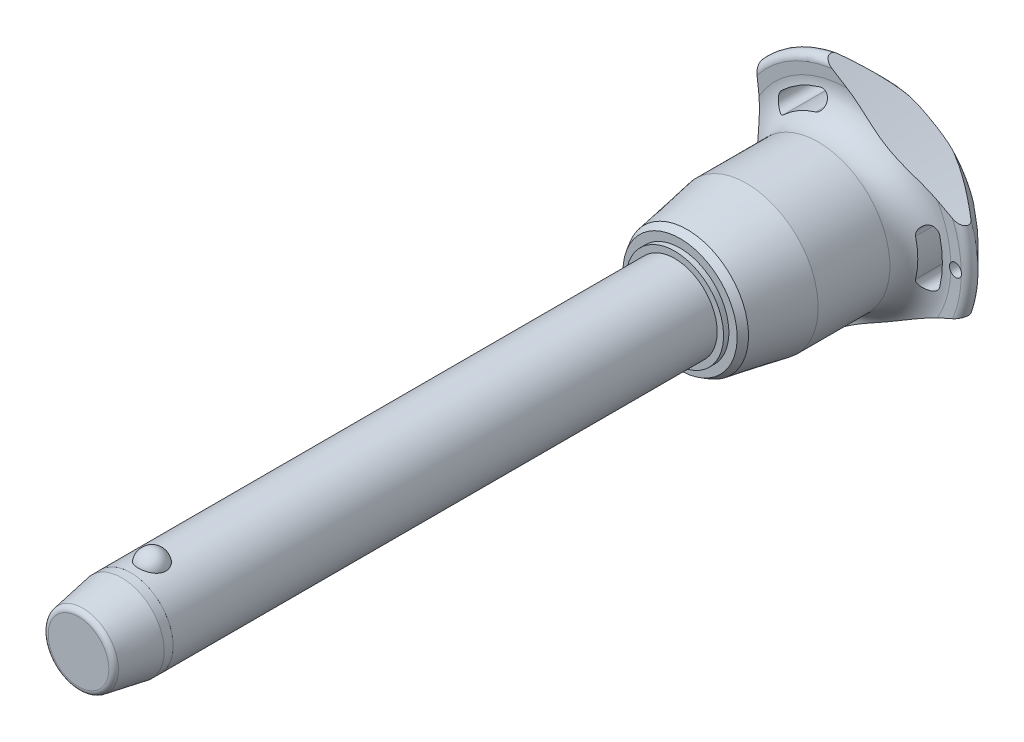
from build123d import *

# Parameters (mm, degrees)
SKETCH1_R           = 10
BOSS_EXTRUDE1_DEPTH = 120
SKETCH2_R           = 8.75
BOSS_EXTRUDE2_DEPTH = 50.7
BOSS_EXTRUDE3_START = 20.5
SKETCH1_2_R         = 10
BOSS_EXTRUDE3_DEPTH = 20.5
CHAMFER1_SIZE       = 10.25
CHAMFER1_SIZE2      = 1.807351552
FILLET1_R           = 1.25
SKETCH6_R           = 176.92625
CUT_EXTRUDE1_DEPTH  = 176.410549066
CIRPATTERN1_COUNT   = 3
SKETCH7_R           = 1.5
CUT_EXTRUDE2_DEPTH  = 176.323744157
SKETCH8_R           = 10
SKETCH8_R_2         = 9.99
CUT_EXTRUDE3_DEPTH  = 12.3


with BuildPart() as part:
    # Sketch1 → Boss-Extrude1 (new body)
    with BuildSketch(Plane.XY):
        Circle(SKETCH1_R)
    extrude(amount=-BOSS_EXTRUDE1_DEPTH)

    # Sketch2 → Boss-Extrude2 (add)
    with BuildSketch(Plane(origin=(0, 0, -120), x_dir=(-1, 0, 0), z_dir=(0, 0, -1))):
        with Locations(Location((0, 0, 0), (0, 0, 180))):
            Circle(SKETCH2_R)
    extrude(amount=BOSS_EXTRUDE2_DEPTH)

    # Sketch3 → Revolve1 (revolve)
    with BuildSketch(Plane(origin=(0, 0, 0), x_dir=(0, 0, -1), z_dir=(1, 0, 0))):
        with BuildLine():
            Line((-3.201562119, 12.5), (-3.201562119, 5.9))
            ThreePointArc((-3.201562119, 5.9), (0.098437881, 9.2), (-3.201562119, 12.5))
        make_face()
        with BuildLine():
            Line((-3.201562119, -5.9), (-3.201562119, -12.5))
            ThreePointArc((-3.201562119, -12.5), (0.098437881, -9.2), (-3.201562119, -5.9))
        make_face()
    revolve(axis=Axis((0, -5.9, 3.201562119), (0, 1, 0)))

    # Sketch1_2 → Boss-Extrude3 (add)
    with BuildSketch(Plane.XY.offset(BOSS_EXTRUDE3_START)):
        Circle(SKETCH1_2_R)
    extrude(amount=-BOSS_EXTRUDE3_DEPTH)

    # Chamfer1
    chamfer1_edges = [part.edges().sort_by_distance(p)[0] for p in [
        (-10, 0, 20.5),
    ]]
    chamfer1_side = [part.faces().sort_by_distance(p)[0] for p in [
        (-10, 0, -49.75),
    ]]
    chamfer(chamfer1_edges, length=CHAMFER1_SIZE, length2=CHAMFER1_SIZE2, reference=chamfer1_side[0])

    # Fillet1
    fillet1_edges = [part.edges().sort_by_distance(p)[0] for p in [
        (-8.192648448, 0, 20.5),
        (-8.75, 0, -170.7),
    ]]
    fillet(fillet1_edges, radius=FILLET1_R)

    # Sketch4 → Revolve2 (revolve)
    with BuildSketch(Plane(origin=(0, 0, 0), x_dir=(0, 0, -1), z_dir=(1, 0, 0)), mode=Mode.PRIVATE) as revolve2_sk:
        Polygon((120, 0), (120, 11.504815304), (121.25, 11.504815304), (121.25, 13.461079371), (122.944174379, 14.439211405), (136.9, 16.9), (153.8, 16.9), (153.8, 0), align=None)
    revolve(revolve2_sk.sketch.rotate(Axis((0, 0, -153.8), (0, 0, 1)), 90), axis=Axis((0, 0, -153.8), (0, 0, 1)))

    # Sketch5 → Revolve3 (revolve)
    with BuildSketch(Plane(origin=(0, 0, 0), x_dir=(0, 0, -1), z_dir=(1, 0, 0)), mode=Mode.PRIVATE) as revolve3_sk:
        with BuildLine():
            Line((160.790129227, 24.271609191), (160.652256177, 26.865060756))
            ThreePointArc((160.652256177, 26.865060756), (161.598671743, 28.411427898), (163.38137085, 28.08137085))
            Line((163.38137085, 28.08137085), (169.763226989, 21.69951471))
            ThreePointArc((169.763226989, 21.69951471), (170.7, 19.381044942), (169.683055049, 17.096604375))
            ThreePointArc((169.683055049, 17.096604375), (164.18864484, 9.321268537), (162.25, 0))
            Line((162.25, 0), (153.8, 0))
            Line((153.8, 0), (153.8, 16.9))
            ThreePointArc((153.8, 16.9), (158.879432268, 19.083427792), (160.790129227, 24.271609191))
        make_face()
    revolve(revolve3_sk.sketch.rotate(Axis((0, 0, -162.25), (0, 0, 1)), 90), axis=Axis((0, 0, -162.25), (0, 0, 1)))

    # Sketch6 → Cut-Extrude1 (cut, through all)
    with BuildSketch(Plane.XY):
        with Locations((-197.42625, 0)):
            Circle(SKETCH6_R)
        with BuildLine():
            ThreePointArc((21.802992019, -5.260839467), (22.428706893, 0), (21.802992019, 5.260839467))
            ThreePointArc((21.802992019, 5.260839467), (19.579234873, 6.620060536), (18.220013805, 4.39630339))
            ThreePointArc((18.220013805, 4.39630339), (18.742902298, 0), (18.220013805, -4.39630339))
            ThreePointArc((18.220013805, -4.39630339), (19.579234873, -6.620060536), (21.802992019, -5.260839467))
        make_face()
    cut_extrude1 = extrude(amount=-CUT_EXTRUDE1_DEPTH, mode=Mode.SUBTRACT)

    # CirPattern1: Cut-Extrude1 ×3 about axis
    cirpattern1_axis = Axis((0, 0, 0), (0, 0, 1))
    for i in range(1, CIRPATTERN1_COUNT):
        add(cut_extrude1.rotate(cirpattern1_axis, i * 360 / CIRPATTERN1_COUNT), mode=Mode.SUBTRACT)

    # Sketch7 → Cut-Extrude2 (cut, through all)
    with BuildSketch(Plane.XY):
        with Locations(Location((25.428706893, 0, 0), (0, 0, 17.230769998))):
            Circle(SKETCH7_R)
    extrude(amount=-CUT_EXTRUDE2_DEPTH, mode=Mode.SUBTRACT)

    # Sketch8 → Cut-Extrude3 (cut)
    with BuildSketch(Plane.XY.offset(20.5)):
        Circle(SKETCH8_R)
        Circle(SKETCH8_R_2, mode=Mode.SUBTRACT)
    extrude(amount=-CUT_EXTRUDE3_DEPTH, mode=Mode.SUBTRACT)


solid = part.part
